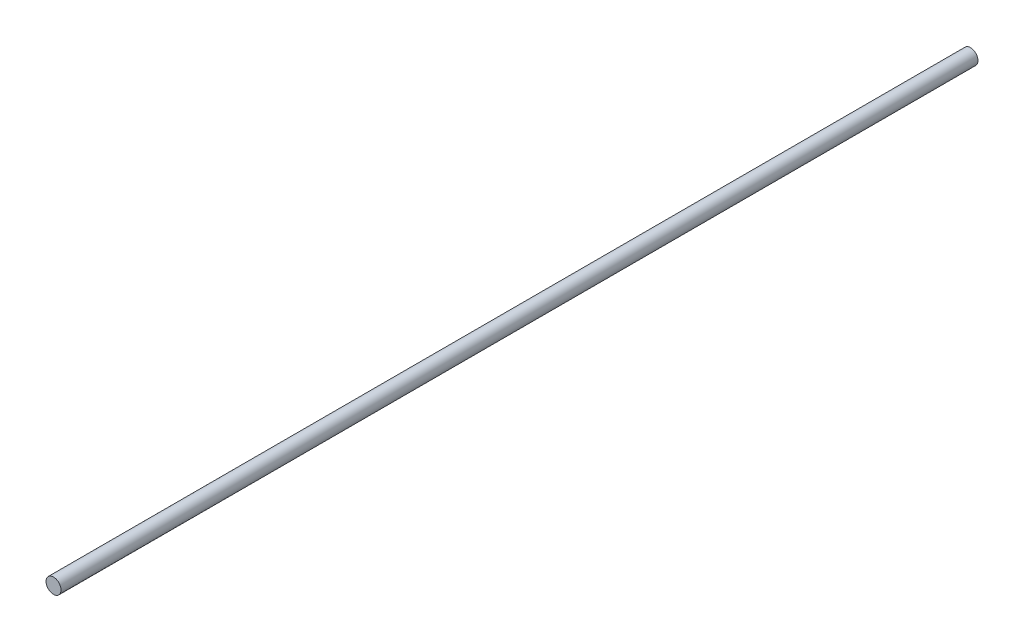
from build123d import *

# Parameters (mm, degrees)
SKETCH1_R      = 6.35
EXTRUDE1_DEPTH = 774.7


with BuildPart() as part:
    # Sketch1 → Extrude1 (new body)
    with BuildSketch(Plane.XY):
        Circle(SKETCH1_R)
    extrude(amount=EXTRUDE1_DEPTH)


solid = part.part
